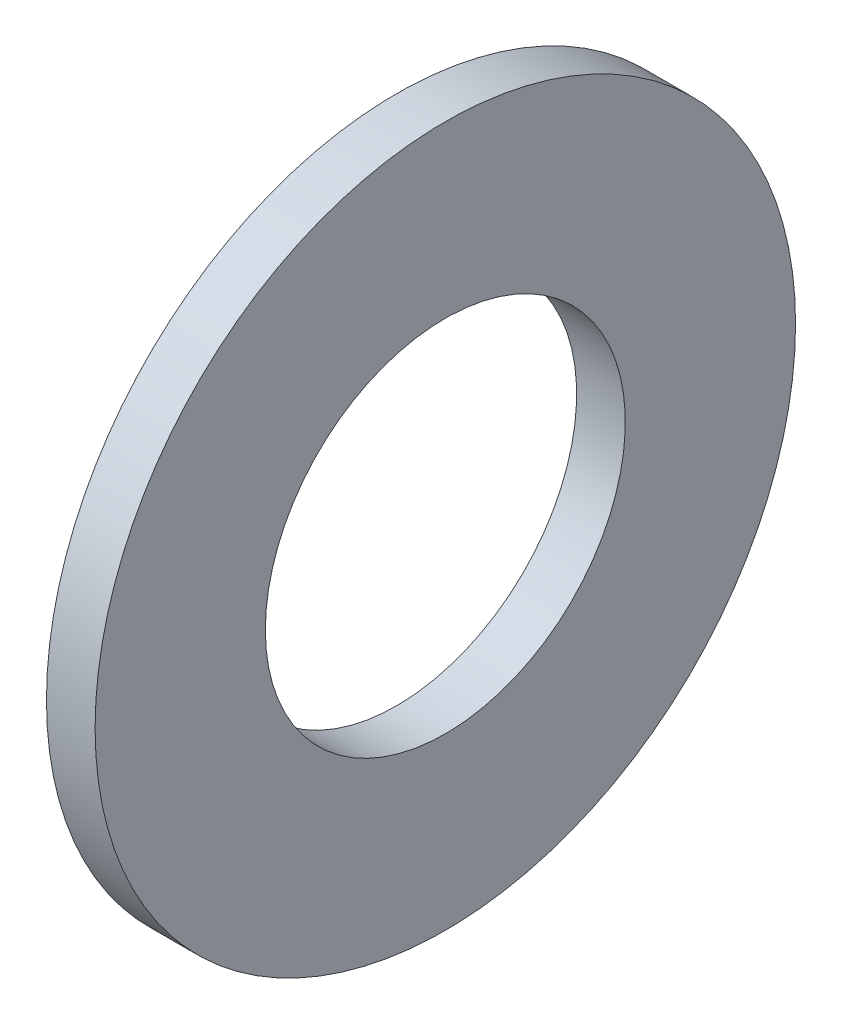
from build123d import *

# Parameters (mm, degrees)
SKETCH1_W = 5
SKETCH1_H = 17.5


with BuildPart() as part:
    # Sketch1 → Base-Revolve (revolve)
    with BuildSketch(Plane.XY, mode=Mode.PRIVATE) as base_revolve_sk:
        with Locations((-2.5, 27.25)):
            Rectangle(SKETCH1_W, SKETCH1_H)
    revolve(base_revolve_sk.sketch.rotate(Axis((-34.925, 0, 0), (1, 0, 0)), 90), axis=Axis((-34.925, 0, 0), (1, 0, 0)))


solid = part.part
